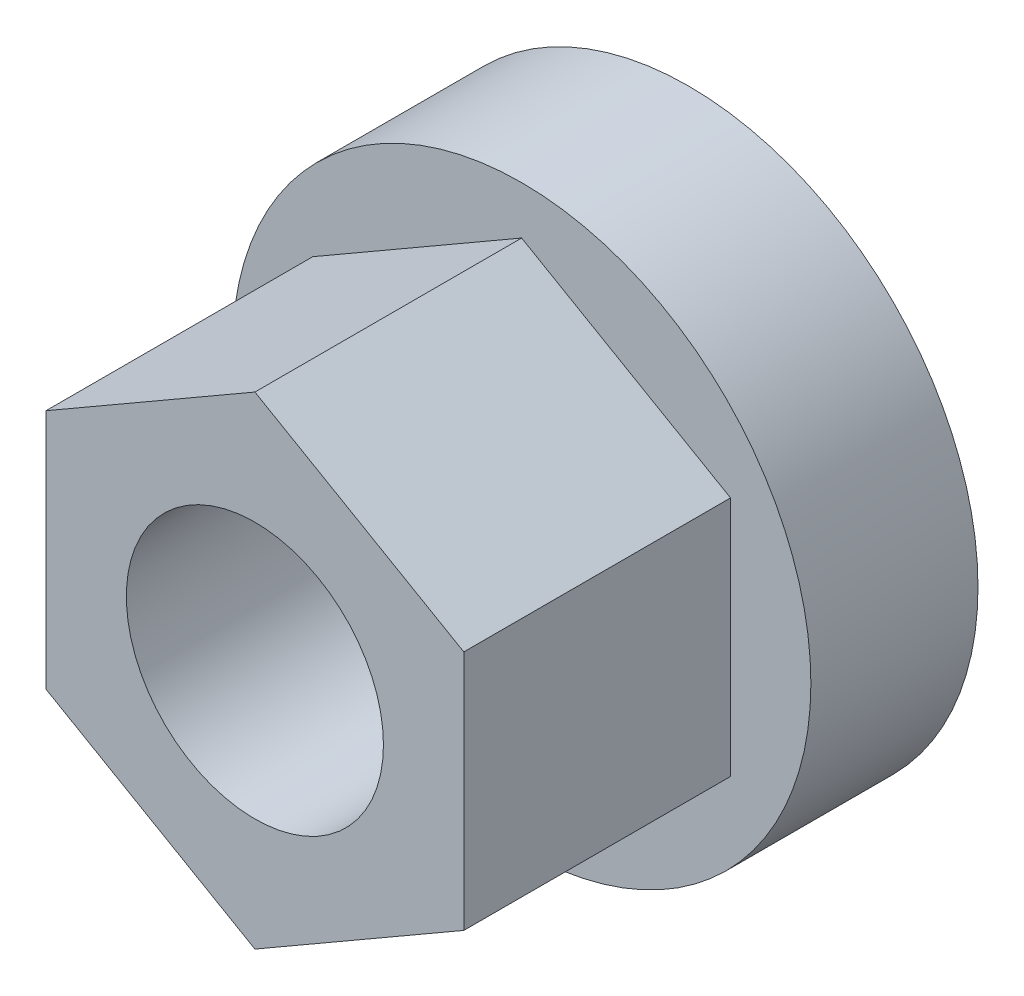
ISO-10303-21;
HEADER;
FILE_DESCRIPTION(('STEP AP214'),'2;1');
FILE_NAME('part.step','',(''),(''),'','','');
FILE_SCHEMA(('AUTOMOTIVE_DESIGN { 1 0 10303 214 1 1 1 1 }'));
ENDSEC;
DATA;
#1=APPLICATION_CONTEXT('core data for automotive mechanical design processes');
#2=APPLICATION_PROTOCOL_DEFINITION('international standard','automotive_design',2000,#1);
#3=PRODUCT_CONTEXT('',#1,'mechanical');
#4=PRODUCT('Part','Part','',(#3));
#5=PRODUCT_RELATED_PRODUCT_CATEGORY('part','',(#4));
#6=PRODUCT_DEFINITION_FORMATION('','',#4);
#7=PRODUCT_DEFINITION_CONTEXT('part definition',#1,'design');
#8=PRODUCT_DEFINITION('design','',#6,#7);
#9=PRODUCT_DEFINITION_SHAPE('','',#8);
#10=(LENGTH_UNIT() NAMED_UNIT(*) SI_UNIT(.MILLI.,.METRE.));
#11=(NAMED_UNIT(*) PLANE_ANGLE_UNIT() SI_UNIT($,.RADIAN.));
#12=(NAMED_UNIT(*) SI_UNIT($,.STERADIAN.) SOLID_ANGLE_UNIT());
#13=UNCERTAINTY_MEASURE_WITH_UNIT(LENGTH_MEASURE(1.E-05),#10,'distance_accuracy_value','');
#14=(GEOMETRIC_REPRESENTATION_CONTEXT(3) GLOBAL_UNCERTAINTY_ASSIGNED_CONTEXT((#13)) GLOBAL_UNIT_ASSIGNED_CONTEXT((#10,
#11,#12)) REPRESENTATION_CONTEXT('',''));
#15=CARTESIAN_POINT('',(0.,0.,0.));
#16=DIRECTION('',(0.,0.,1.));
#17=DIRECTION('',(1.,0.,0.));
#18=AXIS2_PLACEMENT_3D('',#15,#16,#17);
#19=CARTESIAN_POINT('',(-9.,0.,13.5));
#20=DIRECTION('',(0.,0.,-1.));
#21=DIRECTION('',(-1.,0.,0.));
#22=AXIS2_PLACEMENT_3D('',#19,#20,#21);
#23=PLANE('',#22);
#24=CARTESIAN_POINT('',(0.,0.,13.5));
#25=DIRECTION('',(0.,0.,1.));
#26=DIRECTION('',(1.,0.,0.));
#27=AXIS2_PLACEMENT_3D('',#24,#25,#26);
#28=CIRCLE('',#27,4.);
#29=CARTESIAN_POINT('',(4.,0.,13.5));
#30=VERTEX_POINT('',#29);
#31=EDGE_CURVE('E9',#30,#30,#28,.T.);
#32=ORIENTED_EDGE('',*,*,#31,.F.);
#33=EDGE_LOOP('',(#32));
#34=FACE_BOUND('',#33,.T.);
#35=DIRECTION('',(0.86602540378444,-0.5,0.));
#36=VECTOR('',#35,1.);
#37=CARTESIAN_POINT('',(-6.5,-3.7527767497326,13.5));
#38=LINE('',#37,#36);
#39=CARTESIAN_POINT('',(-6.5,-3.7527767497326,13.5));
#40=VERTEX_POINT('',#39);
#41=CARTESIAN_POINT('',(0.,-7.50555349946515,13.5));
#42=VERTEX_POINT('',#41);
#43=EDGE_CURVE('E87',#40,#42,#38,.T.);
#44=ORIENTED_EDGE('',*,*,#43,.T.);
#45=DIRECTION('',(0.866025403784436,0.5,0.));
#46=VECTOR('',#45,1.);
#47=CARTESIAN_POINT('',(0.,-7.50555349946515,13.5));
#48=LINE('',#47,#46);
#49=CARTESIAN_POINT('',(6.5,-3.75277674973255,13.5));
#50=VERTEX_POINT('',#49);
#51=EDGE_CURVE('E85',#42,#50,#48,.T.);
#52=ORIENTED_EDGE('',*,*,#51,.T.);
#53=DIRECTION('',(0.,1.,0.));
#54=VECTOR('',#53,1.);
#55=CARTESIAN_POINT('',(6.5,-3.75277674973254,13.5));
#56=LINE('',#55,#54);
#57=CARTESIAN_POINT('',(6.5,3.75277674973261,13.5));
#58=VERTEX_POINT('',#57);
#59=EDGE_CURVE('E29',#50,#58,#56,.T.);
#60=ORIENTED_EDGE('',*,*,#59,.T.);
#61=DIRECTION('',(-0.866025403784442,0.5,0.));
#62=VECTOR('',#61,1.);
#63=CARTESIAN_POINT('',(6.5,3.75277674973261,13.5));
#64=LINE('',#63,#62);
#65=CARTESIAN_POINT('',(0.,7.50555349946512,13.5));
#66=VERTEX_POINT('',#65);
#67=EDGE_CURVE('E75',#58,#66,#64,.T.);
#68=ORIENTED_EDGE('',*,*,#67,.T.);
#69=DIRECTION('',(-0.86602540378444,-0.5,0.));
#70=VECTOR('',#69,1.);
#71=CARTESIAN_POINT('',(0.,7.50555349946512,13.5));
#72=LINE('',#71,#70);
#73=CARTESIAN_POINT('',(-6.5,3.75277674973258,13.5));
#74=VERTEX_POINT('',#73);
#75=EDGE_CURVE('E80',#66,#74,#72,.T.);
#76=ORIENTED_EDGE('',*,*,#75,.T.);
#77=DIRECTION('',(0.,-1.,0.));
#78=VECTOR('',#77,1.);
#79=CARTESIAN_POINT('',(-6.5,3.75277674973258,13.5));
#80=LINE('',#79,#78);
#81=EDGE_CURVE('E108',#74,#40,#80,.T.);
#82=ORIENTED_EDGE('',*,*,#81,.T.);
#83=EDGE_LOOP('',(#44,#52,#60,#68,#76,#82));
#84=FACE_BOUND('',#83,.T.);
#85=ADVANCED_FACE('F14',(#34,#84),#23,.F.);
#86=CARTESIAN_POINT('',(0.,0.,20.));
#87=DIRECTION('',(0.,0.,1.));
#88=DIRECTION('',(1.,0.,0.));
#89=AXIS2_PLACEMENT_3D('',#86,#87,#88);
#90=CYLINDRICAL_SURFACE('',#89,9.);
#91=CARTESIAN_POINT('',(0.,0.,0.));
#92=DIRECTION('',(0.,0.,1.));
#93=DIRECTION('',(1.,0.,0.));
#94=AXIS2_PLACEMENT_3D('',#91,#92,#93);
#95=CIRCLE('',#94,9.);
#96=CARTESIAN_POINT('',(9.,0.,0.));
#97=VERTEX_POINT('',#96);
#98=EDGE_CURVE('E116',#97,#97,#95,.T.);
#99=ORIENTED_EDGE('',*,*,#98,.T.);
#100=EDGE_LOOP('',(#99));
#101=FACE_BOUND('',#100,.T.);
#102=CARTESIAN_POINT('',(0.,0.,5.2));
#103=DIRECTION('',(0.,0.,1.));
#104=DIRECTION('',(1.,0.,0.));
#105=AXIS2_PLACEMENT_3D('',#102,#103,#104);
#106=CIRCLE('',#105,9.);
#107=CARTESIAN_POINT('',(9.,0.,5.2));
#108=VERTEX_POINT('',#107);
#109=EDGE_CURVE('E17',#108,#108,#106,.T.);
#110=ORIENTED_EDGE('',*,*,#109,.F.);
#111=EDGE_LOOP('',(#110));
#112=FACE_BOUND('',#111,.T.);
#113=ADVANCED_FACE('F127',(#101,#112),#90,.T.);
#114=CARTESIAN_POINT('',(0.,0.,20.));
#115=DIRECTION('',(0.,0.,1.));
#116=DIRECTION('',(1.,0.,0.));
#117=AXIS2_PLACEMENT_3D('',#114,#115,#116);
#118=CYLINDRICAL_SURFACE('',#117,4.);
#119=CARTESIAN_POINT('',(0.,0.,0.));
#120=DIRECTION('',(0.,0.,1.));
#121=DIRECTION('',(1.,0.,0.));
#122=AXIS2_PLACEMENT_3D('',#119,#120,#121);
#123=CIRCLE('',#122,4.);
#124=CARTESIAN_POINT('',(4.,0.,0.));
#125=VERTEX_POINT('',#124);
#126=EDGE_CURVE('E22',#125,#125,#123,.T.);
#127=ORIENTED_EDGE('',*,*,#126,.F.);
#128=EDGE_LOOP('',(#127));
#129=FACE_BOUND('',#128,.T.);
#130=ORIENTED_EDGE('',*,*,#31,.T.);
#131=EDGE_LOOP('',(#130));
#132=FACE_BOUND('',#131,.T.);
#133=ADVANCED_FACE('F124',(#129,#132),#118,.F.);
#134=CARTESIAN_POINT('',(-4.,0.,0.));
#135=DIRECTION('',(0.,0.,1.));
#136=DIRECTION('',(1.,0.,0.));
#137=AXIS2_PLACEMENT_3D('',#134,#135,#136);
#138=PLANE('',#137);
#139=ORIENTED_EDGE('',*,*,#98,.F.);
#140=EDGE_LOOP('',(#139));
#141=FACE_BOUND('',#140,.T.);
#142=ORIENTED_EDGE('',*,*,#126,.T.);
#143=EDGE_LOOP('',(#142));
#144=FACE_BOUND('',#143,.T.);
#145=ADVANCED_FACE('F122',(#141,#144),#138,.F.);
#146=CARTESIAN_POINT('',(0.,0.,5.2));
#147=DIRECTION('',(0.,0.,1.));
#148=DIRECTION('',(1.,0.,0.));
#149=AXIS2_PLACEMENT_3D('',#146,#147,#148);
#150=PLANE('',#149);
#151=DIRECTION('',(0.,-1.,0.));
#152=VECTOR('',#151,1.);
#153=CARTESIAN_POINT('',(-6.5,3.75277674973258,5.2));
#154=LINE('',#153,#152);
#155=CARTESIAN_POINT('',(-6.5,3.75277674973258,5.2));
#156=VERTEX_POINT('',#155);
#157=CARTESIAN_POINT('',(-6.5,-3.7527767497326,5.2));
#158=VERTEX_POINT('',#157);
#159=EDGE_CURVE('E92',#156,#158,#154,.T.);
#160=ORIENTED_EDGE('',*,*,#159,.F.);
#161=DIRECTION('',(-0.86602540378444,-0.5,0.));
#162=VECTOR('',#161,1.);
#163=CARTESIAN_POINT('',(0.,7.50555349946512,5.2));
#164=LINE('',#163,#162);
#165=CARTESIAN_POINT('',(0.,7.50555349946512,5.2));
#166=VERTEX_POINT('',#165);
#167=EDGE_CURVE('E96',#166,#156,#164,.T.);
#168=ORIENTED_EDGE('',*,*,#167,.F.);
#169=DIRECTION('',(-0.866025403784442,0.5,0.));
#170=VECTOR('',#169,1.);
#171=CARTESIAN_POINT('',(6.5,3.75277674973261,5.2));
#172=LINE('',#171,#170);
#173=CARTESIAN_POINT('',(6.5,3.75277674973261,5.2));
#174=VERTEX_POINT('',#173);
#175=EDGE_CURVE('E99',#174,#166,#172,.T.);
#176=ORIENTED_EDGE('',*,*,#175,.F.);
#177=DIRECTION('',(0.,1.,0.));
#178=VECTOR('',#177,1.);
#179=CARTESIAN_POINT('',(6.5,-3.75277674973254,5.2));
#180=LINE('',#179,#178);
#181=CARTESIAN_POINT('',(6.5,-3.75277674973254,5.2));
#182=VERTEX_POINT('',#181);
#183=EDGE_CURVE('E37',#182,#174,#180,.T.);
#184=ORIENTED_EDGE('',*,*,#183,.F.);
#185=DIRECTION('',(0.866025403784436,0.5,0.));
#186=VECTOR('',#185,1.);
#187=CARTESIAN_POINT('',(0.,-7.50555349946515,5.2));
#188=LINE('',#187,#186);
#189=CARTESIAN_POINT('',(0.,-7.50555349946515,5.2));
#190=VERTEX_POINT('',#189);
#191=EDGE_CURVE('E102',#190,#182,#188,.T.);
#192=ORIENTED_EDGE('',*,*,#191,.F.);
#193=DIRECTION('',(0.86602540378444,-0.5,0.));
#194=VECTOR('',#193,1.);
#195=CARTESIAN_POINT('',(-6.5,-3.7527767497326,5.2));
#196=LINE('',#195,#194);
#197=EDGE_CURVE('E105',#158,#190,#196,.T.);
#198=ORIENTED_EDGE('',*,*,#197,.F.);
#199=EDGE_LOOP('',(#160,#168,#176,#184,#192,#198));
#200=FACE_BOUND('',#199,.T.);
#201=ORIENTED_EDGE('',*,*,#109,.T.);
#202=EDGE_LOOP('',(#201));
#203=FACE_BOUND('',#202,.T.);
#204=ADVANCED_FACE('F144',(#200,#203),#150,.T.);
#205=CARTESIAN_POINT('',(-6.5,-3.7527767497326,5.2));
#206=DIRECTION('',(-0.5,-0.86602540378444,0.));
#207=DIRECTION('',(0.86602540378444,-0.5,0.));
#208=AXIS2_PLACEMENT_3D('',#205,#206,#207);
#209=PLANE('',#208);
#210=DIRECTION('',(0.,0.,1.));
#211=VECTOR('',#210,1.);
#212=CARTESIAN_POINT('',(-6.5,-3.7527767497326,5.2));
#213=LINE('',#212,#211);
#214=EDGE_CURVE('E114',#158,#40,#213,.T.);
#215=ORIENTED_EDGE('',*,*,#214,.F.);
#216=ORIENTED_EDGE('',*,*,#197,.T.);
#217=DIRECTION('',(0.,0.,1.));
#218=VECTOR('',#217,1.);
#219=CARTESIAN_POINT('',(0.,-7.50555349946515,5.2));
#220=LINE('',#219,#218);
#221=EDGE_CURVE('E95',#190,#42,#220,.T.);
#222=ORIENTED_EDGE('',*,*,#221,.T.);
#223=ORIENTED_EDGE('',*,*,#43,.F.);
#224=EDGE_LOOP('',(#215,#216,#222,#223));
#225=FACE_BOUND('',#224,.T.);
#226=ADVANCED_FACE('F152',(#225),#209,.T.);
#227=CARTESIAN_POINT('',(-6.5,3.75277674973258,5.2));
#228=DIRECTION('',(-1.,0.,0.));
#229=DIRECTION('',(0.,0.,1.));
#230=AXIS2_PLACEMENT_3D('',#227,#228,#229);
#231=PLANE('',#230);
#232=DIRECTION('',(0.,0.,1.));
#233=VECTOR('',#232,1.);
#234=CARTESIAN_POINT('',(-6.5,3.75277674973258,5.2));
#235=LINE('',#234,#233);
#236=EDGE_CURVE('E112',#156,#74,#235,.T.);
#237=ORIENTED_EDGE('',*,*,#236,.F.);
#238=ORIENTED_EDGE('',*,*,#159,.T.);
#239=ORIENTED_EDGE('',*,*,#214,.T.);
#240=ORIENTED_EDGE('',*,*,#81,.F.);
#241=EDGE_LOOP('',(#237,#238,#239,#240));
#242=FACE_BOUND('',#241,.T.);
#243=ADVANCED_FACE('F158',(#242),#231,.T.);
#244=CARTESIAN_POINT('',(0.,7.50555349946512,5.2));
#245=DIRECTION('',(-0.5,0.86602540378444,0.));
#246=DIRECTION('',(-0.86602540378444,-0.5,0.));
#247=AXIS2_PLACEMENT_3D('',#244,#245,#246);
#248=PLANE('',#247);
#249=DIRECTION('',(0.,0.,1.));
#250=VECTOR('',#249,1.);
#251=CARTESIAN_POINT('',(0.,7.50555349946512,5.2));
#252=LINE('',#251,#250);
#253=EDGE_CURVE('E71',#166,#66,#252,.T.);
#254=ORIENTED_EDGE('',*,*,#253,.F.);
#255=ORIENTED_EDGE('',*,*,#167,.T.);
#256=ORIENTED_EDGE('',*,*,#236,.T.);
#257=ORIENTED_EDGE('',*,*,#75,.F.);
#258=EDGE_LOOP('',(#254,#255,#256,#257));
#259=FACE_BOUND('',#258,.T.);
#260=ADVANCED_FACE('F169',(#259),#248,.T.);
#261=CARTESIAN_POINT('',(6.5,3.75277674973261,5.2));
#262=DIRECTION('',(0.499999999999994,0.866025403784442,0.));
#263=DIRECTION('',(-0.866025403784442,0.5,0.));
#264=AXIS2_PLACEMENT_3D('',#261,#262,#263);
#265=PLANE('',#264);
#266=DIRECTION('',(0.,0.,1.));
#267=VECTOR('',#266,1.);
#268=CARTESIAN_POINT('',(6.5,3.75277674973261,5.2));
#269=LINE('',#268,#267);
#270=EDGE_CURVE('E66',#174,#58,#269,.T.);
#271=ORIENTED_EDGE('',*,*,#270,.F.);
#272=ORIENTED_EDGE('',*,*,#175,.T.);
#273=ORIENTED_EDGE('',*,*,#253,.T.);
#274=ORIENTED_EDGE('',*,*,#67,.F.);
#275=EDGE_LOOP('',(#271,#272,#273,#274));
#276=FACE_BOUND('',#275,.T.);
#277=ADVANCED_FACE('F76',(#276),#265,.T.);
#278=CARTESIAN_POINT('',(6.5,-3.75277674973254,5.2));
#279=DIRECTION('',(1.,0.,0.));
#280=DIRECTION('',(0.,0.,-1.));
#281=AXIS2_PLACEMENT_3D('',#278,#279,#280);
#282=PLANE('',#281);
#283=DIRECTION('',(0.,0.,1.));
#284=VECTOR('',#283,1.);
#285=CARTESIAN_POINT('',(6.5,-3.75277674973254,5.2));
#286=LINE('',#285,#284);
#287=EDGE_CURVE('E72',#182,#50,#286,.T.);
#288=ORIENTED_EDGE('',*,*,#287,.F.);
#289=ORIENTED_EDGE('',*,*,#183,.T.);
#290=ORIENTED_EDGE('',*,*,#270,.T.);
#291=ORIENTED_EDGE('',*,*,#59,.F.);
#292=EDGE_LOOP('',(#288,#289,#290,#291));
#293=FACE_BOUND('',#292,.T.);
#294=ADVANCED_FACE('F68',(#293),#282,.T.);
#295=CARTESIAN_POINT('',(0.,-7.50555349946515,5.2));
#296=DIRECTION('',(0.5,-0.866025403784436,0.));
#297=DIRECTION('',(0.866025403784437,0.5,0.));
#298=AXIS2_PLACEMENT_3D('',#295,#296,#297);
#299=PLANE('',#298);
#300=ORIENTED_EDGE('',*,*,#191,.T.);
#301=ORIENTED_EDGE('',*,*,#287,.T.);
#302=ORIENTED_EDGE('',*,*,#51,.F.);
#303=ORIENTED_EDGE('',*,*,#221,.F.);
#304=EDGE_LOOP('',(#300,#301,#302,#303));
#305=FACE_BOUND('',#304,.T.);
#306=ADVANCED_FACE('F175',(#305),#299,.T.);
#307=CLOSED_SHELL('',(#85,#113,#133,#145,#204,#226,#243,#260,#277,#294,#306));
#308=MANIFOLD_SOLID_BREP('B1',#307);
#309=ADVANCED_BREP_SHAPE_REPRESENTATION('',(#18,#308),#14);
#310=SHAPE_DEFINITION_REPRESENTATION(#9,#309);
ENDSEC;
END-ISO-10303-21;
